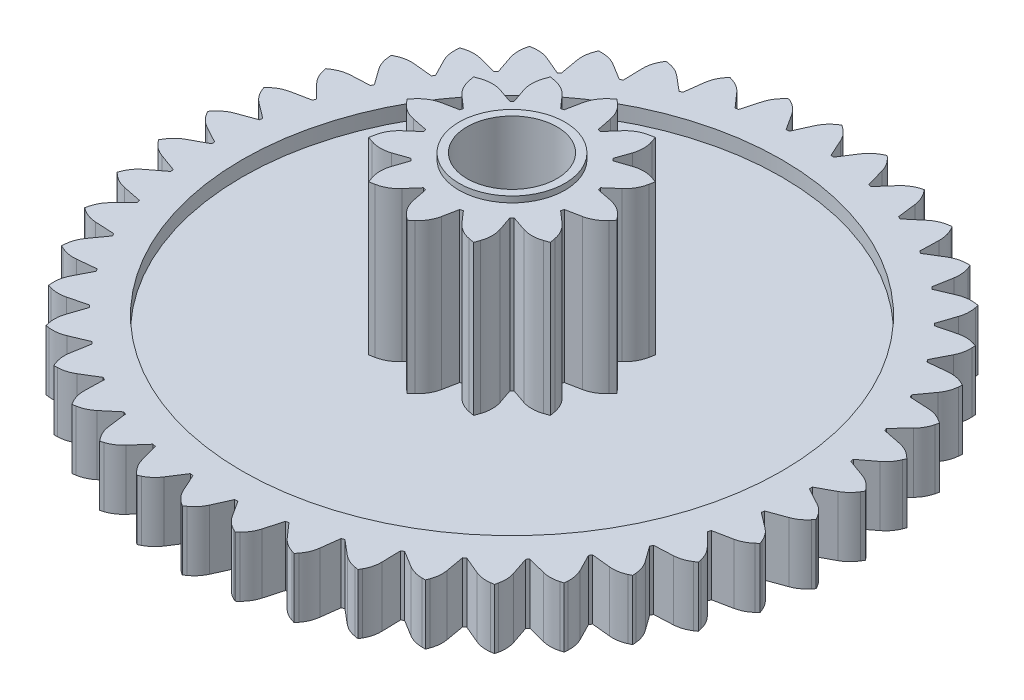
from build123d import *

# Parameters (mm, degrees)
SKETCH1_R           = 11
BOSS_EXTRUDE1_DEPTH = 2
SKETCH2_OUTSIDE_W   = 30.236
SKETCH2_OUTSIDE_H   = 30.236
CUT_EXTRUDE1_DEPTH  = 2
SKETCH3_R           = 9
CUT_EXTRUDE2_DEPTH  = 0.5
CUT_EXTRUDE3_START  = -0.5
SKETCH4_R           = 9
SKETCH4_R_2         = 6.5
SKETCH4_R_3         = 6
CUT_EXTRUDE3_DEPTH  = 0.5
FILLET1_R           = 0.2
BOSS_EXTRUDE2_DEPTH = 5
SKETCH6_R           = 1.5
CUT_EXTRUDE4_DEPTH  = 17.839663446
BOSS_EXTRUDE3_START = 0.2
SKETCH7_R           = 1.769136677
SKETCH7_R_2         = 1.5
BOSS_EXTRUDE3_DEPTH = 0.2


with BuildPart() as part:
    # Sketch1 → Boss-Extrude1 (new body)
    with BuildSketch(Plane(origin=(0, 0, 0), x_dir=(1, 0, 0), z_dir=(0, 1, 0))):
        with Locations(Location((0, 0, 0), (0, 0, 270))):
            Circle(SKETCH1_R)
    extrude(amount=BOSS_EXTRUDE1_DEPTH)

    # Sketch2 outside → Cut-Extrude1 (cut)
    with BuildSketch(Plane(origin=(0, 2, 0), x_dir=(1, 0, 0), z_dir=(0, 1, 0))):
        Rectangle(SKETCH2_OUTSIDE_W, SKETCH2_OUTSIDE_H)
        with BuildLine():
            Line((0.79486256, 9.937629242), (0.695142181, 9.945102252))
            Line((0.695142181, 9.945102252), (0.434286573, 10.524405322))
            ThreePointArc((0.434286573, 10.524405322), (0.292252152, 10.752119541), (0.094771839, 10.933858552))
            Line((0.094771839, 10.933858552), (0, 11))
            Line((0, 11), (-0.094771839, 10.933858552))
            ThreePointArc((-0.094771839, 10.933858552), (-0.292252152, 10.752119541), (-0.434286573, 10.524405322))
            Line((-0.434286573, 10.524405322), (-0.695142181, 9.945102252))
            Line((-0.695142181, 9.945102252), (-0.79486256, 9.937629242))
            Line((-0.79486256, 9.937629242), (-1.139145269, 10.471583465))
            ThreePointArc((-1.139145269, 10.471583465), (-1.313532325, 10.675585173), (-1.535893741, 10.825861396))
            Line((-1.535893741, 10.825861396), (-1.639464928, 10.877139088))
            Line((-1.639464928, 10.877139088), (-1.723320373, 10.797611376))
            ThreePointArc((-1.723320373, 10.797611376), (-1.8915082, 10.588469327), (-1.99801717, 10.342129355))
            Line((-1.99801717, 10.342129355), (-2.169618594, 9.730418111))
            Line((-2.169618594, 9.730418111), (-2.267111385, 9.708166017))
            Line((-2.267111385, 9.708166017), (-2.687130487, 10.184843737))
            ThreePointArc((-2.687130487, 10.184843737), (-2.889974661, 10.360575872), (-3.132249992, 10.476032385))
            Line((-3.132249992, 10.476032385), (-3.242306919, 10.511300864))
            Line((-3.242306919, 10.511300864), (-3.313372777, 10.420163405))
            ThreePointArc((-3.313372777, 10.420163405), (-3.44851108, 10.188290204), (-3.517115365, 9.928827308))
            Line((-3.517115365, 9.928827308), (-3.595629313, 9.298372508))
            Line((-3.595629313, 9.298372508), (-3.688716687, 9.261838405))
            Line((-3.688716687, 9.261838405), (-4.175089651, 9.67059143))
            ThreePointArc((-4.175089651, 9.67059143), (-4.401859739, 9.814128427), (-4.658636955, 9.892186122))
            Line((-4.658636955, 9.892186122), (-4.77272113, 9.910657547))
            Line((-4.77272113, 9.910657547), (-4.829409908, 9.809946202))
            ThreePointArc((-4.829409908, 9.809946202), (-4.928479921, 9.560521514), (-4.957647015, 9.293731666))
            Line((-4.957647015, 9.293731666), (-4.941319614, 8.658616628))
            Line((-4.941319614, 8.658616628), (-5.027922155, 8.608616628))
            Line((-5.027922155, 8.608616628), (-5.569784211, 8.940314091))
            ThreePointArc((-5.569784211, 8.940314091), (-5.815414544, 9.048449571), (-6.080957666, 9.087364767))
            Line((-6.080957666, 9.087364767), (-6.196520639, 9.088626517))
            Line((-6.196520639, 9.088626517), (-6.237566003, 8.980591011))
            ThreePointArc((-6.237566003, 8.980591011), (-6.298354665, 8.719186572), (-6.287433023, 8.451029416))
            Line((-6.287433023, 8.451029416), (-6.176629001, 7.825441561))
            Line((-6.176629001, 7.825441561), (-6.254812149, 7.763092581))
            Line((-6.254812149, 7.763092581), (-6.840058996, 8.010324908))
            ThreePointArc((-6.840058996, 8.010324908), (-7.099062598, 8.080643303), (-7.367439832, 8.079546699))
            Line((-7.367439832, 8.079546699), (-7.481900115, 8.06357059))
            Line((-7.481900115, 8.06357059), (-7.50638518, 7.950624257))
            ThreePointArc((-7.50638518, 7.950624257), (-7.527534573, 7.683079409), (-7.476768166, 7.419545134))
            Line((-7.476768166, 7.419545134), (-7.273962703, 6.817459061))
            Line((-7.273962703, 6.817459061), (-7.341979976, 6.744153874))
            Line((-7.341979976, 6.744153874), (-7.957538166, 6.901398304))
            ThreePointArc((-7.957538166, 6.901398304), (-8.224129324, 6.932328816), (-8.489345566, 6.89124491))
            Line((-8.489345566, 6.89124491), (-8.600146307, 6.85838782))
            Line((-8.600146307, 6.85838782), (-8.607524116, 6.743053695))
            ThreePointArc((-8.607524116, 6.743053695), (-8.588561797, 6.475344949), (-8.499084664, 6.222320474))
            Line((-8.499084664, 6.222320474), (-8.208808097, 5.657185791))
            Line((-8.208808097, 5.657185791), (-8.265140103, 5.574561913))
            Line((-8.265140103, 5.574561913), (-8.897259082, 5.638305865))
            ThreePointArc((-8.897259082, 5.638305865), (-9.165482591, 5.629157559), (-9.421613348, 5.549004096))
            Line((-9.421613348, 5.549004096), (-9.526279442, 5.5))
            Line((-9.526279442, 5.5), (-9.516385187, 5.384854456))
            ThreePointArc((-9.516385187, 5.384854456), (-9.457734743, 5.122961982), (-9.331545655, 4.886099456))
            Line((-9.331545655, 4.886099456), (-8.960282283, 4.370540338))
            Line((-8.960282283, 4.370540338), (-9.003670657, 4.280443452))
            Line((-9.003670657, 4.280443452), (-9.638229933, 4.249262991))
            ThreePointArc((-9.638229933, 4.249262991), (-9.902094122, 4.200240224), (-10.143417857, 4.082807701))
            Line((-10.143417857, 4.082807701), (-10.239611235, 4.018751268))
            Line((-10.239611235, 4.018751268), (-10.212665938, 3.906366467))
            ThreePointArc((-10.212665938, 3.906366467), (-10.115637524, 3.656140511), (-9.955555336, 3.440731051))
            Line((-9.955555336, 3.440731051), (-9.51159857, 2.986264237))
            Line((-9.51159857, 2.986264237), (-9.541074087, 2.890706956))
            Line((-9.541074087, 2.890706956), (-10.163898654, 2.765298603))
            ThreePointArc((-10.163898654, 2.765298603), (-10.417509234, 2.677496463), (-10.638635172, 2.525408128))
            Line((-10.638635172, 2.525408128), (-10.724207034, 2.447730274))
            Line((-10.724207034, 2.447730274), (-10.680812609, 2.340616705))
            ThreePointArc((-10.680812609, 2.340616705), (-10.547573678, 2.107646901), (-10.357174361, 1.9185024))
            Line((-10.357174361, 1.9185024), (-9.850441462, 1.535279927))
            Line((-9.850441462, 1.535279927), (-9.865345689, 1.436396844))
            Line((-9.865345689, 1.436396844), (-10.462522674, 1.219562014))
            ThreePointArc((-10.462522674, 1.219562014), (-10.700214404, 1.094941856), (-10.896202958, 0.911595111))
            Line((-10.896202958, 0.911595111), (-10.969241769, 0.822031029))
            Line((-10.969241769, 0.822031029), (-10.910367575, 0.722581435))
            ThreePointArc((-10.910367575, 0.722581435), (-10.743894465, 0.512071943), (-10.527431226, 0.353417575))
            Line((-10.527431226, 0.353417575), (-9.969241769, 0.05))
            Line((-9.969241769, 0.05), (-9.969241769, -0.05))
            Line((-9.969241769, -0.05), (-10.527431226, -0.353417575))
            ThreePointArc((-10.527431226, -0.353417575), (-10.743894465, -0.512071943), (-10.910367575, -0.722581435))
            Line((-10.910367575, -0.722581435), (-10.969241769, -0.822031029))
            Line((-10.969241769, -0.822031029), (-10.896202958, -0.911595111))
            ThreePointArc((-10.896202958, -0.911595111), (-10.700214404, -1.094941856), (-10.462522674, -1.219562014))
            Line((-10.462522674, -1.219562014), (-9.865345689, -1.436396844))
            Line((-9.865345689, -1.436396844), (-9.850441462, -1.535279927))
            Line((-9.850441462, -1.535279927), (-10.357174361, -1.9185024))
            ThreePointArc((-10.357174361, -1.9185024), (-10.547573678, -2.107646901), (-10.680812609, -2.340616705))
            Line((-10.680812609, -2.340616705), (-10.724207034, -2.447730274))
            Line((-10.724207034, -2.447730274), (-10.638635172, -2.525408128))
            ThreePointArc((-10.638635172, -2.525408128), (-10.417509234, -2.677496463), (-10.163898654, -2.765298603))
            Line((-10.163898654, -2.765298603), (-9.541074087, -2.890706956))
            Line((-9.541074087, -2.890706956), (-9.51159857, -2.986264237))
            Line((-9.51159857, -2.986264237), (-9.955555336, -3.440731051))
            ThreePointArc((-9.955555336, -3.440731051), (-10.115637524, -3.656140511), (-10.212665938, -3.906366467))
            Line((-10.212665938, -3.906366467), (-10.239611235, -4.018751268))
            Line((-10.239611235, -4.018751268), (-10.143417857, -4.082807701))
            ThreePointArc((-10.143417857, -4.082807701), (-9.902094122, -4.200240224), (-9.638229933, -4.249262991))
            Line((-9.638229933, -4.249262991), (-9.003670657, -4.280443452))
            Line((-9.003670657, -4.280443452), (-8.960282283, -4.370540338))
            Line((-8.960282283, -4.370540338), (-9.331545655, -4.886099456))
            ThreePointArc((-9.331545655, -4.886099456), (-9.457734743, -5.122961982), (-9.516385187, -5.384854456))
            Line((-9.516385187, -5.384854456), (-9.526279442, -5.5))
            Line((-9.526279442, -5.5), (-9.421613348, -5.549004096))
            ThreePointArc((-9.421613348, -5.549004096), (-9.165482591, -5.629157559), (-8.897259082, -5.638305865))
            Line((-8.897259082, -5.638305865), (-8.265140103, -5.574561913))
            Line((-8.265140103, -5.574561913), (-8.208808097, -5.657185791))
            Line((-8.208808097, -5.657185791), (-8.499084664, -6.222320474))
            ThreePointArc((-8.499084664, -6.222320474), (-8.588561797, -6.475344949), (-8.607524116, -6.743053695))
            Line((-8.607524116, -6.743053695), (-8.600146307, -6.85838782))
            Line((-8.600146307, -6.85838782), (-8.489345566, -6.89124491))
            ThreePointArc((-8.489345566, -6.89124491), (-8.224129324, -6.932328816), (-7.957538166, -6.901398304))
            Line((-7.957538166, -6.901398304), (-7.341979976, -6.744153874))
            Line((-7.341979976, -6.744153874), (-7.273962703, -6.817459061))
            Line((-7.273962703, -6.817459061), (-7.476768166, -7.419545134))
            ThreePointArc((-7.476768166, -7.419545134), (-7.527534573, -7.683079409), (-7.50638518, -7.950624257))
            Line((-7.50638518, -7.950624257), (-7.481900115, -8.06357059))
            Line((-7.481900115, -8.06357059), (-7.367439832, -8.079546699))
            ThreePointArc((-7.367439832, -8.079546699), (-7.099062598, -8.080643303), (-6.840058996, -8.010324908))
            Line((-6.840058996, -8.010324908), (-6.254812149, -7.763092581))
            Line((-6.254812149, -7.763092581), (-6.176629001, -7.825441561))
            Line((-6.176629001, -7.825441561), (-6.287433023, -8.451029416))
            ThreePointArc((-6.287433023, -8.451029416), (-6.298354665, -8.719186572), (-6.237566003, -8.980591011))
            Line((-6.237566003, -8.980591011), (-6.196520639, -9.088626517))
            Line((-6.196520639, -9.088626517), (-6.080957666, -9.087364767))
            ThreePointArc((-6.080957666, -9.087364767), (-5.815414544, -9.048449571), (-5.569784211, -8.940314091))
            Line((-5.569784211, -8.940314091), (-5.027922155, -8.608616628))
            Line((-5.027922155, -8.608616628), (-4.941319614, -8.658616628))
            Line((-4.941319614, -8.658616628), (-4.957647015, -9.293731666))
            ThreePointArc((-4.957647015, -9.293731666), (-4.928479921, -9.560521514), (-4.829409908, -9.809946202))
            Line((-4.829409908, -9.809946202), (-4.77272113, -9.910657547))
            Line((-4.77272113, -9.910657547), (-4.658636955, -9.892186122))
            ThreePointArc((-4.658636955, -9.892186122), (-4.401859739, -9.814128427), (-4.175089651, -9.67059143))
            Line((-4.175089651, -9.67059143), (-3.688716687, -9.261838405))
            Line((-3.688716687, -9.261838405), (-3.595629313, -9.298372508))
            Line((-3.595629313, -9.298372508), (-3.517115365, -9.928827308))
            ThreePointArc((-3.517115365, -9.928827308), (-3.44851108, -10.188290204), (-3.313372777, -10.420163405))
            Line((-3.313372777, -10.420163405), (-3.242306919, -10.511300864))
            Line((-3.242306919, -10.511300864), (-3.132249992, -10.476032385))
            ThreePointArc((-3.132249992, -10.476032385), (-2.889974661, -10.360575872), (-2.687130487, -10.184843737))
            Line((-2.687130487, -10.184843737), (-2.267111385, -9.708166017))
            Line((-2.267111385, -9.708166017), (-2.169618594, -9.730418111))
            Line((-2.169618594, -9.730418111), (-1.99801717, -10.342129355))
            ThreePointArc((-1.99801717, -10.342129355), (-1.8915082, -10.588469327), (-1.723320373, -10.797611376))
            Line((-1.723320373, -10.797611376), (-1.639464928, -10.877139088))
            Line((-1.639464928, -10.877139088), (-1.535893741, -10.825861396))
            ThreePointArc((-1.535893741, -10.825861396), (-1.313532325, -10.675585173), (-1.139145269, -10.471583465))
            Line((-1.139145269, -10.471583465), (-0.79486256, -9.937629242))
            Line((-0.79486256, -9.937629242), (-0.695142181, -9.945102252))
            Line((-0.695142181, -9.945102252), (-0.434286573, -10.524405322))
            ThreePointArc((-0.434286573, -10.524405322), (-0.292252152, -10.752119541), (-0.094771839, -10.933858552))
            Line((-0.094771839, -10.933858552), (0, -11))
            Line((0, -11), (0.094771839, -10.933858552))
            ThreePointArc((0.094771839, -10.933858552), (0.292252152, -10.752119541), (0.434286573, -10.524405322))
            Line((0.434286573, -10.524405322), (0.695142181, -9.945102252))
            Line((0.695142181, -9.945102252), (0.79486256, -9.937629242))
            Line((0.79486256, -9.937629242), (1.139145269, -10.471583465))
            ThreePointArc((1.139145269, -10.471583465), (1.313532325, -10.675585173), (1.535893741, -10.825861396))
            Line((1.535893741, -10.825861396), (1.639464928, -10.877139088))
            Line((1.639464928, -10.877139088), (1.723320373, -10.797611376))
            ThreePointArc((1.723320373, -10.797611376), (1.8915082, -10.588469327), (1.99801717, -10.342129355))
            Line((1.99801717, -10.342129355), (2.169618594, -9.730418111))
            Line((2.169618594, -9.730418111), (2.267111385, -9.708166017))
            Line((2.267111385, -9.708166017), (2.687130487, -10.184843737))
            ThreePointArc((2.687130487, -10.184843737), (2.889974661, -10.360575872), (3.132249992, -10.476032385))
            Line((3.132249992, -10.476032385), (3.242306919, -10.511300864))
            Line((3.242306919, -10.511300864), (3.313372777, -10.420163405))
            ThreePointArc((3.313372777, -10.420163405), (3.44851108, -10.188290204), (3.517115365, -9.928827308))
            Line((3.517115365, -9.928827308), (3.595629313, -9.298372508))
            Line((3.595629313, -9.298372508), (3.688716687, -9.261838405))
            Line((3.688716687, -9.261838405), (4.175089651, -9.67059143))
            ThreePointArc((4.175089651, -9.67059143), (4.401859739, -9.814128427), (4.658636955, -9.892186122))
            Line((4.658636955, -9.892186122), (4.77272113, -9.910657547))
            Line((4.77272113, -9.910657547), (4.829409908, -9.809946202))
            ThreePointArc((4.829409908, -9.809946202), (4.928479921, -9.560521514), (4.957647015, -9.293731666))
            Line((4.957647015, -9.293731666), (4.941319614, -8.658616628))
            Line((4.941319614, -8.658616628), (5.027922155, -8.608616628))
            Line((5.027922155, -8.608616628), (5.569784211, -8.940314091))
            ThreePointArc((5.569784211, -8.940314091), (5.815414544, -9.048449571), (6.080957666, -9.087364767))
            Line((6.080957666, -9.087364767), (6.196520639, -9.088626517))
            Line((6.196520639, -9.088626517), (6.237566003, -8.980591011))
            ThreePointArc((6.237566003, -8.980591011), (6.298354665, -8.719186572), (6.287433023, -8.451029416))
            Line((6.287433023, -8.451029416), (6.176629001, -7.825441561))
            Line((6.176629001, -7.825441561), (6.254812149, -7.763092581))
            Line((6.254812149, -7.763092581), (6.840058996, -8.010324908))
            ThreePointArc((6.840058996, -8.010324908), (7.099062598, -8.080643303), (7.367439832, -8.079546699))
            Line((7.367439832, -8.079546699), (7.481900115, -8.06357059))
            Line((7.481900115, -8.06357059), (7.50638518, -7.950624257))
            ThreePointArc((7.50638518, -7.950624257), (7.527534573, -7.683079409), (7.476768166, -7.419545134))
            Line((7.476768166, -7.419545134), (7.273962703, -6.817459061))
            Line((7.273962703, -6.817459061), (7.341979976, -6.744153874))
            Line((7.341979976, -6.744153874), (7.957538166, -6.901398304))
            ThreePointArc((7.957538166, -6.901398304), (8.224129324, -6.932328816), (8.489345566, -6.89124491))
            Line((8.489345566, -6.89124491), (8.600146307, -6.85838782))
            Line((8.600146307, -6.85838782), (8.607524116, -6.743053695))
            ThreePointArc((8.607524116, -6.743053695), (8.588561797, -6.475344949), (8.499084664, -6.222320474))
            Line((8.499084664, -6.222320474), (8.208808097, -5.657185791))
            Line((8.208808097, -5.657185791), (8.265140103, -5.574561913))
            Line((8.265140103, -5.574561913), (8.897259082, -5.638305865))
            ThreePointArc((8.897259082, -5.638305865), (9.165482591, -5.629157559), (9.421613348, -5.549004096))
            Line((9.421613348, -5.549004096), (9.526279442, -5.5))
            Line((9.526279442, -5.5), (9.516385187, -5.384854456))
            ThreePointArc((9.516385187, -5.384854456), (9.457734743, -5.122961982), (9.331545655, -4.886099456))
            Line((9.331545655, -4.886099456), (8.960282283, -4.370540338))
            Line((8.960282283, -4.370540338), (9.003670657, -4.280443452))
            Line((9.003670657, -4.280443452), (9.638229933, -4.249262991))
            ThreePointArc((9.638229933, -4.249262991), (9.902094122, -4.200240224), (10.143417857, -4.082807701))
            Line((10.143417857, -4.082807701), (10.239611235, -4.018751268))
            Line((10.239611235, -4.018751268), (10.212665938, -3.906366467))
            ThreePointArc((10.212665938, -3.906366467), (10.115637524, -3.656140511), (9.955555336, -3.440731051))
            Line((9.955555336, -3.440731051), (9.51159857, -2.986264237))
            Line((9.51159857, -2.986264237), (9.541074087, -2.890706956))
            Line((9.541074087, -2.890706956), (10.163898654, -2.765298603))
            ThreePointArc((10.163898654, -2.765298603), (10.417509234, -2.677496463), (10.638635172, -2.525408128))
            Line((10.638635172, -2.525408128), (10.724207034, -2.447730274))
            Line((10.724207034, -2.447730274), (10.680812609, -2.340616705))
            ThreePointArc((10.680812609, -2.340616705), (10.547573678, -2.107646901), (10.357174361, -1.9185024))
            Line((10.357174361, -1.9185024), (9.850441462, -1.535279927))
            Line((9.850441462, -1.535279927), (9.865345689, -1.436396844))
            Line((9.865345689, -1.436396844), (10.462522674, -1.219562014))
            ThreePointArc((10.462522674, -1.219562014), (10.700214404, -1.094941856), (10.896202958, -0.911595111))
            Line((10.896202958, -0.911595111), (10.969241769, -0.822031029))
            Line((10.969241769, -0.822031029), (10.910367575, -0.722581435))
            ThreePointArc((10.910367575, -0.722581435), (10.743894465, -0.512071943), (10.527431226, -0.353417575))
            Line((10.527431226, -0.353417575), (9.969241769, -0.05))
            Line((9.969241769, -0.05), (9.969241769, 0.05))
            Line((9.969241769, 0.05), (10.527431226, 0.353417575))
            ThreePointArc((10.527431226, 0.353417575), (10.743894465, 0.512071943), (10.910367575, 0.722581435))
            Line((10.910367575, 0.722581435), (10.969241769, 0.822031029))
            Line((10.969241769, 0.822031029), (10.896202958, 0.911595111))
            ThreePointArc((10.896202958, 0.911595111), (10.700214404, 1.094941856), (10.462522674, 1.219562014))
            Line((10.462522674, 1.219562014), (9.865345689, 1.436396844))
            Line((9.865345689, 1.436396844), (9.850441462, 1.535279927))
            Line((9.850441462, 1.535279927), (10.357174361, 1.9185024))
            ThreePointArc((10.357174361, 1.9185024), (10.547573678, 2.107646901), (10.680812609, 2.340616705))
            Line((10.680812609, 2.340616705), (10.724207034, 2.447730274))
            Line((10.724207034, 2.447730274), (10.638635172, 2.525408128))
            ThreePointArc((10.638635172, 2.525408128), (10.417509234, 2.677496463), (10.163898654, 2.765298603))
            Line((10.163898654, 2.765298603), (9.541074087, 2.890706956))
            Line((9.541074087, 2.890706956), (9.51159857, 2.986264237))
            Line((9.51159857, 2.986264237), (9.955555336, 3.440731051))
            ThreePointArc((9.955555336, 3.440731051), (10.115637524, 3.656140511), (10.212665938, 3.906366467))
            Line((10.212665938, 3.906366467), (10.239611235, 4.018751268))
            Line((10.239611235, 4.018751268), (10.143417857, 4.082807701))
            ThreePointArc((10.143417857, 4.082807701), (9.902094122, 4.200240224), (9.638229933, 4.249262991))
            Line((9.638229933, 4.249262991), (9.003670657, 4.280443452))
            Line((9.003670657, 4.280443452), (8.960282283, 4.370540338))
            Line((8.960282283, 4.370540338), (9.331545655, 4.886099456))
            ThreePointArc((9.331545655, 4.886099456), (9.457734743, 5.122961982), (9.516385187, 5.384854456))
            Line((9.516385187, 5.384854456), (9.526279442, 5.5))
            Line((9.526279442, 5.5), (9.421613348, 5.549004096))
            ThreePointArc((9.421613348, 5.549004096), (9.165482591, 5.629157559), (8.897259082, 5.638305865))
            Line((8.897259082, 5.638305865), (8.265140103, 5.574561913))
            Line((8.265140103, 5.574561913), (8.208808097, 5.657185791))
            Line((8.208808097, 5.657185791), (8.499084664, 6.222320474))
            ThreePointArc((8.499084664, 6.222320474), (8.588561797, 6.475344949), (8.607524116, 6.743053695))
            Line((8.607524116, 6.743053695), (8.600146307, 6.85838782))
            Line((8.600146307, 6.85838782), (8.489345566, 6.89124491))
            ThreePointArc((8.489345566, 6.89124491), (8.224129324, 6.932328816), (7.957538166, 6.901398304))
            Line((7.957538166, 6.901398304), (7.341979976, 6.744153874))
            Line((7.341979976, 6.744153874), (7.273962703, 6.817459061))
            Line((7.273962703, 6.817459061), (7.476768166, 7.419545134))
            ThreePointArc((7.476768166, 7.419545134), (7.527534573, 7.683079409), (7.50638518, 7.950624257))
            Line((7.50638518, 7.950624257), (7.481900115, 8.06357059))
            Line((7.481900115, 8.06357059), (7.367439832, 8.079546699))
            ThreePointArc((7.367439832, 8.079546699), (7.099062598, 8.080643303), (6.840058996, 8.010324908))
            Line((6.840058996, 8.010324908), (6.254812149, 7.763092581))
            Line((6.254812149, 7.763092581), (6.176629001, 7.825441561))
            Line((6.176629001, 7.825441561), (6.287433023, 8.451029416))
            ThreePointArc((6.287433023, 8.451029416), (6.298354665, 8.719186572), (6.237566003, 8.980591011))
            Line((6.237566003, 8.980591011), (6.196520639, 9.088626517))
            Line((6.196520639, 9.088626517), (6.080957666, 9.087364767))
            ThreePointArc((6.080957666, 9.087364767), (5.815414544, 9.048449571), (5.569784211, 8.940314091))
            Line((5.569784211, 8.940314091), (5.027922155, 8.608616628))
            Line((5.027922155, 8.608616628), (4.941319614, 8.658616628))
            Line((4.941319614, 8.658616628), (4.957647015, 9.293731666))
            ThreePointArc((4.957647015, 9.293731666), (4.928479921, 9.560521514), (4.829409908, 9.809946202))
            Line((4.829409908, 9.809946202), (4.77272113, 9.910657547))
            Line((4.77272113, 9.910657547), (4.658636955, 9.892186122))
            ThreePointArc((4.658636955, 9.892186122), (4.401859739, 9.814128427), (4.175089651, 9.67059143))
            Line((4.175089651, 9.67059143), (3.688716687, 9.261838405))
            Line((3.688716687, 9.261838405), (3.595629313, 9.298372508))
            Line((3.595629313, 9.298372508), (3.517115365, 9.928827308))
            ThreePointArc((3.517115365, 9.928827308), (3.44851108, 10.188290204), (3.313372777, 10.420163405))
            Line((3.313372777, 10.420163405), (3.242306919, 10.511300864))
            Line((3.242306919, 10.511300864), (3.132249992, 10.476032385))
            ThreePointArc((3.132249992, 10.476032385), (2.889974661, 10.360575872), (2.687130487, 10.184843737))
            Line((2.687130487, 10.184843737), (2.267111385, 9.708166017))
            Line((2.267111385, 9.708166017), (2.169618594, 9.730418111))
            Line((2.169618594, 9.730418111), (1.99801717, 10.342129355))
            ThreePointArc((1.99801717, 10.342129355), (1.8915082, 10.588469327), (1.723320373, 10.797611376))
            Line((1.723320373, 10.797611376), (1.639464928, 10.877139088))
            Line((1.639464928, 10.877139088), (1.535893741, 10.825861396))
            ThreePointArc((1.535893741, 10.825861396), (1.313532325, 10.675585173), (1.139145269, 10.471583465))
            Line((1.139145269, 10.471583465), (0.79486256, 9.937629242))
        make_face(mode=Mode.SUBTRACT)
    extrude(amount=-CUT_EXTRUDE1_DEPTH, mode=Mode.SUBTRACT)

    # Sketch3 → Cut-Extrude2 (cut)
    with BuildSketch(Plane(origin=(0, 2, 0), x_dir=(1, 0, 0), z_dir=(0, 1, 0))):
        with Locations(Location((0, 0, 0), (0, 0, 270))):
            Circle(SKETCH3_R)
    extrude(amount=-CUT_EXTRUDE2_DEPTH, mode=Mode.SUBTRACT)

    # Sketch4 → Cut-Extrude3 (cut)
    # profile 1 of 2: a face of its own
    with BuildSketch(Plane.XZ.offset(CUT_EXTRUDE3_START)):
        with Locations(Location((0, 0, 0), (0, 0, 90))):
            Circle(SKETCH4_R)
        with Locations(Location((0, 0, 0), (0, 0, 270))):
            Circle(SKETCH4_R_2, mode=Mode.SUBTRACT)
    # profile 2 of 2: a face of its own
    with BuildSketch(Plane.XZ.offset(CUT_EXTRUDE3_START)):
        with Locations(Location((0, 0, 0), (0, 0, 270))):
            Circle(SKETCH4_R_3)
    extrude(amount=CUT_EXTRUDE3_DEPTH, mode=Mode.SUBTRACT)

    # Fillet1
    fillet1_edges = [part.edges().sort_by_distance(p)[0] for p in [
        (0, 0, 6.5),
        (0, 0, 6),
    ]]
    fillet(fillet1_edges, radius=FILLET1_R)

    # Sketch5 → Boss-Extrude2 (add)
    with BuildSketch(Plane(origin=(0, 1.5, 0), x_dir=(1, 0, 0), z_dir=(0, 1, 0))):
        with BuildLine():
            Line((0.664477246, 2.286677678), (0.567884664, 2.312559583))
            Line((0.567884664, 2.312559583), (0.467800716, 2.816836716))
            ThreePointArc((0.467800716, 2.816836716), (0.350776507, 3.125923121), (0.139395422, 3.37998435))
            Line((0.139395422, 3.37998435), (0, 3.5))
            Line((0, 3.5), (-0.139395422, 3.37998435))
            ThreePointArc((-0.139395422, 3.37998435), (-0.350776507, 3.125923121), (-0.467800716, 2.816836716))
            Line((-0.467800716, 2.816836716), (-0.567884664, 2.312559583))
            Line((-0.567884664, 2.312559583), (-0.664477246, 2.286677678))
            Line((-0.664477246, 2.286677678), (-1.003291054, 2.673352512))
            ThreePointArc((-1.003291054, 2.673352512), (-1.259180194, 2.882517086), (-1.569272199, 2.996850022))
            Line((-1.569272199, 2.996850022), (-1.75, 3.031088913))
            Line((-1.75, 3.031088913), (-1.810712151, 2.8574546))
            ThreePointArc((-1.810712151, 2.8574546), (-1.866742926, 2.531740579), (-1.813545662, 2.205551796))
            Line((-1.813545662, 2.205551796), (-1.648082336, 1.718793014))
            Line((-1.648082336, 1.718793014), (-1.718793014, 1.648082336))
            Line((-1.718793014, 1.648082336), (-2.205551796, 1.813545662))
            ThreePointArc((-2.205551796, 1.813545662), (-2.531740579, 1.866742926), (-2.8574546, 1.810712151))
            Line((-2.8574546, 1.810712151), (-3.031088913, 1.75))
            Line((-3.031088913, 1.75), (-2.996850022, 1.569272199))
            ThreePointArc((-2.996850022, 1.569272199), (-2.882517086, 1.259180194), (-2.673352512, 1.003291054))
            Line((-2.673352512, 1.003291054), (-2.286677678, 0.664477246))
            Line((-2.286677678, 0.664477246), (-2.312559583, 0.567884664))
            Line((-2.312559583, 0.567884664), (-2.816836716, 0.467800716))
            ThreePointArc((-2.816836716, 0.467800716), (-3.125923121, 0.350776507), (-3.37998435, 0.139395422))
            Line((-3.37998435, 0.139395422), (-3.5, 0))
            Line((-3.5, 0), (-3.37998435, -0.139395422))
            ThreePointArc((-3.37998435, -0.139395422), (-3.125923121, -0.350776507), (-2.816836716, -0.467800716))
            Line((-2.816836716, -0.467800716), (-2.312559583, -0.567884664))
            Line((-2.312559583, -0.567884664), (-2.286677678, -0.664477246))
            Line((-2.286677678, -0.664477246), (-2.673352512, -1.003291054))
            ThreePointArc((-2.673352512, -1.003291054), (-2.882517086, -1.259180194), (-2.996850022, -1.569272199))
            Line((-2.996850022, -1.569272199), (-3.031088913, -1.75))
            Line((-3.031088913, -1.75), (-2.8574546, -1.810712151))
            ThreePointArc((-2.8574546, -1.810712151), (-2.531740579, -1.866742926), (-2.205551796, -1.813545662))
            Line((-2.205551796, -1.813545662), (-1.718793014, -1.648082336))
            Line((-1.718793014, -1.648082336), (-1.648082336, -1.718793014))
            Line((-1.648082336, -1.718793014), (-1.813545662, -2.205551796))
            ThreePointArc((-1.813545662, -2.205551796), (-1.866742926, -2.531740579), (-1.810712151, -2.8574546))
            Line((-1.810712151, -2.8574546), (-1.75, -3.031088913))
            Line((-1.75, -3.031088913), (-1.569272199, -2.996850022))
            ThreePointArc((-1.569272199, -2.996850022), (-1.259180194, -2.882517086), (-1.003291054, -2.673352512))
            Line((-1.003291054, -2.673352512), (-0.664477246, -2.286677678))
            Line((-0.664477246, -2.286677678), (-0.567884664, -2.312559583))
            Line((-0.567884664, -2.312559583), (-0.467800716, -2.816836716))
            ThreePointArc((-0.467800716, -2.816836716), (-0.350776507, -3.125923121), (-0.139395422, -3.37998435))
            Line((-0.139395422, -3.37998435), (0, -3.5))
            Line((0, -3.5), (0.139395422, -3.37998435))
            ThreePointArc((0.139395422, -3.37998435), (0.350776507, -3.125923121), (0.467800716, -2.816836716))
            Line((0.467800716, -2.816836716), (0.567884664, -2.312559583))
            Line((0.567884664, -2.312559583), (0.664477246, -2.286677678))
            Line((0.664477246, -2.286677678), (1.003291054, -2.673352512))
            ThreePointArc((1.003291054, -2.673352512), (1.259180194, -2.882517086), (1.569272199, -2.996850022))
            Line((1.569272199, -2.996850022), (1.75, -3.031088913))
            Line((1.75, -3.031088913), (1.810712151, -2.8574546))
            ThreePointArc((1.810712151, -2.8574546), (1.866742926, -2.531740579), (1.813545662, -2.205551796))
            Line((1.813545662, -2.205551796), (1.648082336, -1.718793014))
            Line((1.648082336, -1.718793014), (1.718793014, -1.648082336))
            Line((1.718793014, -1.648082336), (2.205551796, -1.813545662))
            ThreePointArc((2.205551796, -1.813545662), (2.531740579, -1.866742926), (2.8574546, -1.810712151))
            Line((2.8574546, -1.810712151), (3.031088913, -1.75))
            Line((3.031088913, -1.75), (2.996850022, -1.569272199))
            ThreePointArc((2.996850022, -1.569272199), (2.882517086, -1.259180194), (2.673352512, -1.003291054))
            Line((2.673352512, -1.003291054), (2.286677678, -0.664477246))
            Line((2.286677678, -0.664477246), (2.312559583, -0.567884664))
            Line((2.312559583, -0.567884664), (2.816836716, -0.467800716))
            ThreePointArc((2.816836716, -0.467800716), (3.125923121, -0.350776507), (3.37998435, -0.139395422))
            Line((3.37998435, -0.139395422), (3.5, 0))
            Line((3.5, 0), (3.37998435, 0.139395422))
            ThreePointArc((3.37998435, 0.139395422), (3.125923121, 0.350776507), (2.816836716, 0.467800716))
            Line((2.816836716, 0.467800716), (2.312559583, 0.567884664))
            Line((2.312559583, 0.567884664), (2.286677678, 0.664477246))
            Line((2.286677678, 0.664477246), (2.673352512, 1.003291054))
            ThreePointArc((2.673352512, 1.003291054), (2.882517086, 1.259180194), (2.996850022, 1.569272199))
            Line((2.996850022, 1.569272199), (3.031088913, 1.75))
            Line((3.031088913, 1.75), (2.8574546, 1.810712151))
            ThreePointArc((2.8574546, 1.810712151), (2.531740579, 1.866742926), (2.205551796, 1.813545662))
            Line((2.205551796, 1.813545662), (1.718793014, 1.648082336))
            Line((1.718793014, 1.648082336), (1.648082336, 1.718793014))
            Line((1.648082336, 1.718793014), (1.813545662, 2.205551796))
            ThreePointArc((1.813545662, 2.205551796), (1.866742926, 2.531740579), (1.810712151, 2.8574546))
            Line((1.810712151, 2.8574546), (1.75, 3.031088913))
            Line((1.75, 3.031088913), (1.569272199, 2.996850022))
            ThreePointArc((1.569272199, 2.996850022), (1.259180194, 2.882517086), (1.003291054, 2.673352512))
            Line((1.003291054, 2.673352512), (0.664477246, 2.286677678))
        make_face()
    extrude(amount=BOSS_EXTRUDE2_DEPTH)

    # Sketch6 → Cut-Extrude4 (cut, through all)
    with BuildSketch(Plane(origin=(0, 6.5, 0), x_dir=(1, 0, 0), z_dir=(0, 1, 0))):
        with Locations(Location((0, 0, 0), (0, 0, 270))):
            Circle(SKETCH6_R)
    extrude(amount=-CUT_EXTRUDE4_DEPTH, mode=Mode.SUBTRACT)

    # Sketch7 → Boss-Extrude3 (add)
    with BuildSketch(Plane(origin=(0, 6.5, 0), x_dir=(1, 0, 0), z_dir=(0, 1, 0)).offset(BOSS_EXTRUDE3_START)):
        with Locations(Location((0, 0, 0), (0, 0, 270))):
            Circle(SKETCH7_R)
        with Locations(Location((0, 0, 0), (0, 0, 270))):
            Circle(SKETCH7_R_2, mode=Mode.SUBTRACT)
    extrude(amount=-BOSS_EXTRUDE3_DEPTH)


solid = part.part
